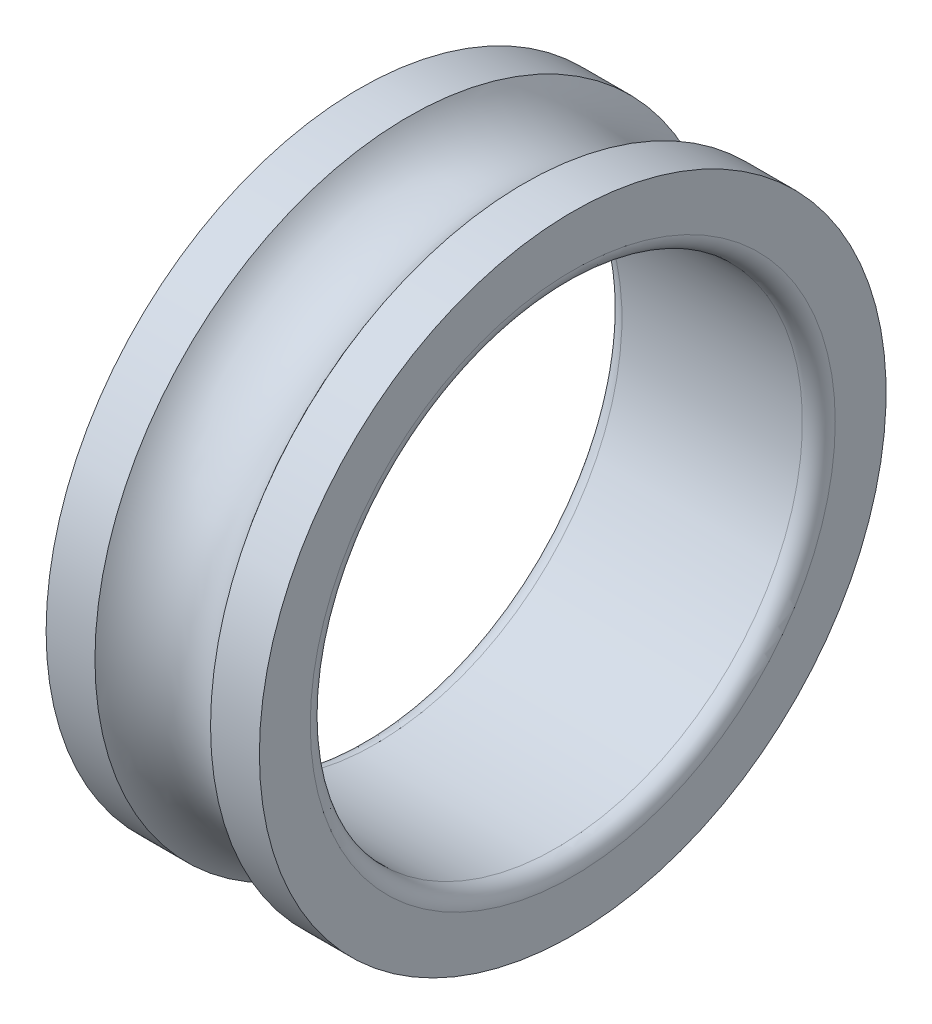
ISO-10303-21;
HEADER;
FILE_DESCRIPTION(('STEP AP214'),'2;1');
FILE_NAME('part.step','',(''),(''),'','','');
FILE_SCHEMA(('AUTOMOTIVE_DESIGN { 1 0 10303 214 1 1 1 1 }'));
ENDSEC;
DATA;
#1=APPLICATION_CONTEXT('core data for automotive mechanical design processes');
#2=APPLICATION_PROTOCOL_DEFINITION('international standard','automotive_design',2000,#1);
#3=PRODUCT_CONTEXT('',#1,'mechanical');
#4=PRODUCT('Part','Part','',(#3));
#5=PRODUCT_RELATED_PRODUCT_CATEGORY('part','',(#4));
#6=PRODUCT_DEFINITION_FORMATION('','',#4);
#7=PRODUCT_DEFINITION_CONTEXT('part definition',#1,'design');
#8=PRODUCT_DEFINITION('design','',#6,#7);
#9=PRODUCT_DEFINITION_SHAPE('','',#8);
#10=(LENGTH_UNIT() NAMED_UNIT(*) SI_UNIT(.MILLI.,.METRE.));
#11=(NAMED_UNIT(*) PLANE_ANGLE_UNIT() SI_UNIT($,.RADIAN.));
#12=(NAMED_UNIT(*) SI_UNIT($,.STERADIAN.) SOLID_ANGLE_UNIT());
#13=UNCERTAINTY_MEASURE_WITH_UNIT(LENGTH_MEASURE(1.E-05),#10,'distance_accuracy_value','');
#14=(GEOMETRIC_REPRESENTATION_CONTEXT(3) GLOBAL_UNCERTAINTY_ASSIGNED_CONTEXT((#13)) GLOBAL_UNIT_ASSIGNED_CONTEXT((#10,
#11,#12)) REPRESENTATION_CONTEXT('',''));
#15=CARTESIAN_POINT('',(0.,0.,0.));
#16=DIRECTION('',(0.,0.,1.));
#17=DIRECTION('',(1.,0.,0.));
#18=AXIS2_PLACEMENT_3D('',#15,#16,#17);
#19=CARTESIAN_POINT('',(0.,0.,0.));
#20=DIRECTION('',(-1.,0.,0.));
#21=DIRECTION('',(0.,0.,1.));
#22=AXIS2_PLACEMENT_3D('',#19,#20,#21);
#23=CYLINDRICAL_SURFACE('',#22,19.1);
#24=CARTESIAN_POINT('',(0.,0.,0.));
#25=DIRECTION('',(-1.,0.,0.));
#26=DIRECTION('',(0.,0.,1.));
#27=AXIS2_PLACEMENT_3D('',#24,#25,#26);
#28=CIRCLE('',#27,19.1);
#29=CARTESIAN_POINT('',(0.,0.,19.1));
#30=VERTEX_POINT('',#29);
#31=EDGE_CURVE('E10',#30,#30,#28,.T.);
#32=ORIENTED_EDGE('',*,*,#31,.F.);
#33=EDGE_LOOP('',(#32));
#34=FACE_BOUND('',#33,.T.);
#35=CARTESIAN_POINT('',(2.97714801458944,0.,0.));
#36=DIRECTION('',(-1.,0.,0.));
#37=DIRECTION('',(0.,0.,1.));
#38=AXIS2_PLACEMENT_3D('',#35,#36,#37);
#39=CIRCLE('',#38,19.1);
#40=CARTESIAN_POINT('',(2.97714801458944,0.,19.1));
#41=VERTEX_POINT('',#40);
#42=EDGE_CURVE('E56',#41,#41,#39,.T.);
#43=ORIENTED_EDGE('',*,*,#42,.T.);
#44=EDGE_LOOP('',(#43));
#45=FACE_BOUND('',#44,.T.);
#46=ADVANCED_FACE('F14',(#34,#45),#23,.T.);
#47=CARTESIAN_POINT('',(0.,19.1,0.));
#48=DIRECTION('',(1.,0.,0.));
#49=DIRECTION('',(0.,0.,-1.));
#50=AXIS2_PLACEMENT_3D('',#47,#48,#49);
#51=PLANE('',#50);
#52=CARTESIAN_POINT('',(0.,0.,0.));
#53=DIRECTION('',(-1.,0.,0.));
#54=DIRECTION('',(0.,0.,1.));
#55=AXIS2_PLACEMENT_3D('',#52,#53,#54);
#56=CIRCLE('',#55,16.);
#57=CARTESIAN_POINT('',(0.,0.,16.));
#58=VERTEX_POINT('',#57);
#59=EDGE_CURVE('E21',#58,#58,#56,.T.);
#60=ORIENTED_EDGE('',*,*,#59,.F.);
#61=EDGE_LOOP('',(#60));
#62=FACE_BOUND('',#61,.T.);
#63=ORIENTED_EDGE('',*,*,#31,.T.);
#64=EDGE_LOOP('',(#63));
#65=FACE_BOUND('',#64,.T.);
#66=ADVANCED_FACE('F74',(#62,#65),#51,.F.);
#67=CARTESIAN_POINT('',(1.,0.,0.));
#68=DIRECTION('',(-1.,0.,0.));
#69=DIRECTION('',(0.,0.,1.));
#70=AXIS2_PLACEMENT_3D('',#67,#68,#69);
#71=TOROIDAL_SURFACE('',#70,16.,1.);
#72=CARTESIAN_POINT('',(1.,0.,0.));
#73=DIRECTION('',(-1.,0.,0.));
#74=DIRECTION('',(0.,0.,1.));
#75=AXIS2_PLACEMENT_3D('',#72,#73,#74);
#76=CIRCLE('',#75,15.);
#77=CARTESIAN_POINT('',(1.,0.,15.));
#78=VERTEX_POINT('',#77);
#79=EDGE_CURVE('E30',#78,#78,#76,.T.);
#80=ORIENTED_EDGE('',*,*,#79,.F.);
#81=EDGE_LOOP('',(#80));
#82=FACE_BOUND('',#81,.T.);
#83=ORIENTED_EDGE('',*,*,#59,.T.);
#84=EDGE_LOOP('',(#83));
#85=FACE_BOUND('',#84,.T.);
#86=ADVANCED_FACE('F78',(#82,#85),#71,.T.);
#87=CARTESIAN_POINT('',(0.,0.,0.));
#88=DIRECTION('',(-1.,0.,0.));
#89=DIRECTION('',(0.,0.,1.));
#90=AXIS2_PLACEMENT_3D('',#87,#88,#89);
#91=CYLINDRICAL_SURFACE('',#90,15.);
#92=CARTESIAN_POINT('',(12.,0.,0.));
#93=DIRECTION('',(-1.,0.,0.));
#94=DIRECTION('',(0.,0.,1.));
#95=AXIS2_PLACEMENT_3D('',#92,#93,#94);
#96=CIRCLE('',#95,15.);
#97=CARTESIAN_POINT('',(12.,0.,15.));
#98=VERTEX_POINT('',#97);
#99=EDGE_CURVE('E38',#98,#98,#96,.T.);
#100=ORIENTED_EDGE('',*,*,#99,.F.);
#101=EDGE_LOOP('',(#100));
#102=FACE_BOUND('',#101,.T.);
#103=ORIENTED_EDGE('',*,*,#79,.T.);
#104=EDGE_LOOP('',(#103));
#105=FACE_BOUND('',#104,.T.);
#106=ADVANCED_FACE('F82',(#102,#105),#91,.F.);
#107=CARTESIAN_POINT('',(12.,0.,0.));
#108=DIRECTION('',(-1.,0.,0.));
#109=DIRECTION('',(0.,0.,1.));
#110=AXIS2_PLACEMENT_3D('',#107,#108,#109);
#111=TOROIDAL_SURFACE('',#110,16.,1.);
#112=CARTESIAN_POINT('',(13.,0.,0.));
#113=DIRECTION('',(-1.,0.,0.));
#114=DIRECTION('',(0.,0.,1.));
#115=AXIS2_PLACEMENT_3D('',#112,#113,#114);
#116=CIRCLE('',#115,16.);
#117=CARTESIAN_POINT('',(13.,0.,16.));
#118=VERTEX_POINT('',#117);
#119=EDGE_CURVE('E44',#118,#118,#116,.T.);
#120=ORIENTED_EDGE('',*,*,#119,.F.);
#121=EDGE_LOOP('',(#120));
#122=FACE_BOUND('',#121,.T.);
#123=ORIENTED_EDGE('',*,*,#99,.T.);
#124=EDGE_LOOP('',(#123));
#125=FACE_BOUND('',#124,.T.);
#126=ADVANCED_FACE('F88',(#122,#125),#111,.T.);
#127=CARTESIAN_POINT('',(13.,16.,0.));
#128=DIRECTION('',(-1.,0.,0.));
#129=DIRECTION('',(0.,0.,1.));
#130=AXIS2_PLACEMENT_3D('',#127,#128,#129);
#131=PLANE('',#130);
#132=CARTESIAN_POINT('',(13.,0.,0.));
#133=DIRECTION('',(-1.,0.,0.));
#134=DIRECTION('',(0.,0.,1.));
#135=AXIS2_PLACEMENT_3D('',#132,#133,#134);
#136=CIRCLE('',#135,19.1);
#137=CARTESIAN_POINT('',(13.,0.,19.1));
#138=VERTEX_POINT('',#137);
#139=EDGE_CURVE('E48',#138,#138,#136,.T.);
#140=ORIENTED_EDGE('',*,*,#139,.F.);
#141=EDGE_LOOP('',(#140));
#142=FACE_BOUND('',#141,.T.);
#143=ORIENTED_EDGE('',*,*,#119,.T.);
#144=EDGE_LOOP('',(#143));
#145=FACE_BOUND('',#144,.T.);
#146=ADVANCED_FACE('F70',(#142,#145),#131,.F.);
#147=CARTESIAN_POINT('',(0.,0.,0.));
#148=DIRECTION('',(-1.,0.,0.));
#149=DIRECTION('',(0.,0.,1.));
#150=AXIS2_PLACEMENT_3D('',#147,#148,#149);
#151=CYLINDRICAL_SURFACE('',#150,19.1);
#152=CARTESIAN_POINT('',(10.0228519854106,0.,0.));
#153=DIRECTION('',(-1.,0.,0.));
#154=DIRECTION('',(0.,0.,1.));
#155=AXIS2_PLACEMENT_3D('',#152,#153,#154);
#156=CIRCLE('',#155,19.1);
#157=CARTESIAN_POINT('',(10.0228519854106,0.,19.1));
#158=VERTEX_POINT('',#157);
#159=EDGE_CURVE('E52',#158,#158,#156,.T.);
#160=ORIENTED_EDGE('',*,*,#159,.F.);
#161=EDGE_LOOP('',(#160));
#162=FACE_BOUND('',#161,.T.);
#163=ORIENTED_EDGE('',*,*,#139,.T.);
#164=EDGE_LOOP('',(#163));
#165=FACE_BOUND('',#164,.T.);
#166=ADVANCED_FACE('F64',(#162,#165),#151,.T.);
#167=CARTESIAN_POINT('',(6.5,0.,0.));
#168=DIRECTION('',(-1.,0.,0.));
#169=DIRECTION('',(0.,0.,1.));
#170=AXIS2_PLACEMENT_3D('',#167,#168,#169);
#171=TOROIDAL_SURFACE('',#170,21.325,4.16666666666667);
#172=ORIENTED_EDGE('',*,*,#159,.T.);
#173=EDGE_LOOP('',(#172));
#174=FACE_BOUND('',#173,.T.);
#175=ORIENTED_EDGE('',*,*,#42,.F.);
#176=EDGE_LOOP('',(#175));
#177=FACE_BOUND('',#176,.T.);
#178=ADVANCED_FACE('F62',(#174,#177),#171,.F.);
#179=CLOSED_SHELL('',(#46,#66,#86,#106,#126,#146,#166,#178));
#180=MANIFOLD_SOLID_BREP('B1',#179);
#181=ADVANCED_BREP_SHAPE_REPRESENTATION('',(#18,#180),#14);
#182=SHAPE_DEFINITION_REPRESENTATION(#9,#181);
ENDSEC;
END-ISO-10303-21;
